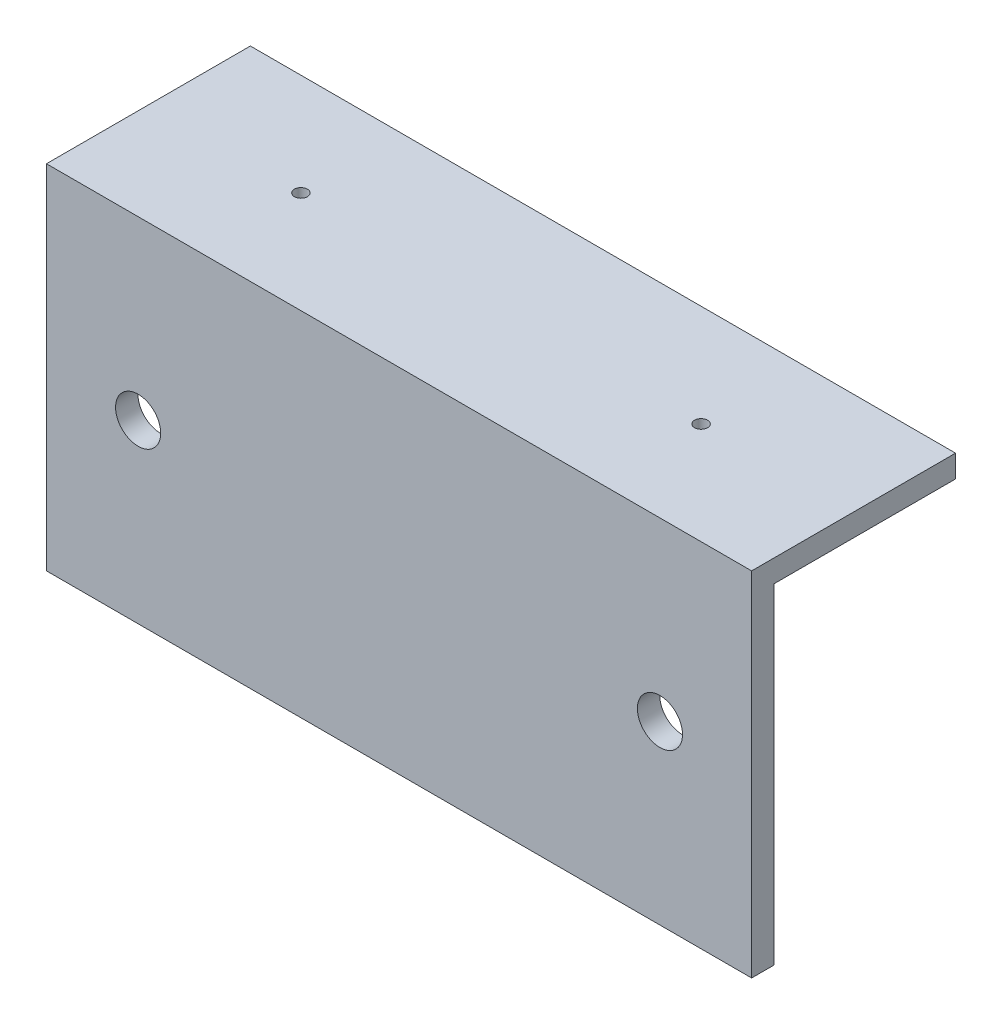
from build123d import *

# Parameters (mm, degrees)
SKETCH1_W           = 50
SKETCH1_H           = 25
SKETCH1_R           = 1.6
BOSS_EXTRUDE1_DEPTH = 1.5875
SKETCH2_W           = 50
SKETCH2_H           = 12.870978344
BOSS_EXTRUDE2_DEPTH = 1.5875
SKETCH3_R           = 0.46355
CUT_EXTRUDE1_DEPTH  = 1.5875


with BuildPart() as part:
    # Sketch1 → Boss-Extrude1 (new body)
    with BuildSketch(Plane.XY):
        Rectangle(SKETCH1_W, SKETCH1_H)
        with Locations((-18.5, 0)):
            Circle(SKETCH1_R, mode=Mode.SUBTRACT)
        with Locations((18.5, 0)):
            Circle(SKETCH1_R, mode=Mode.SUBTRACT)
    extrude(amount=BOSS_EXTRUDE1_DEPTH)

    # Sketch2 → Boss-Extrude2 (add)
    with BuildSketch(Plane(origin=(0, 12.5, 0), x_dir=(1, 0, 0), z_dir=(0, 1, 0))):
        with Locations((0, 6.435489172)):
            Rectangle(SKETCH2_W, SKETCH2_H)
    extrude(amount=-BOSS_EXTRUDE2_DEPTH)

    # Sketch3 → Cut-Extrude1 (cut)
    with BuildSketch(Plane(origin=(0, 12.5, 0), x_dir=(1, 0, 0), z_dir=(0, 1, 0))):
        with Locations(Location((-14.1859, 5.641739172, 0), (0, 0, 270))):
            Circle(SKETCH3_R)
        with Locations(Location((14.1859, 5.641739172, 0), (0, 0, 270))):
            Circle(SKETCH3_R)
    extrude(amount=-CUT_EXTRUDE1_DEPTH, mode=Mode.SUBTRACT)


solid = part.part
